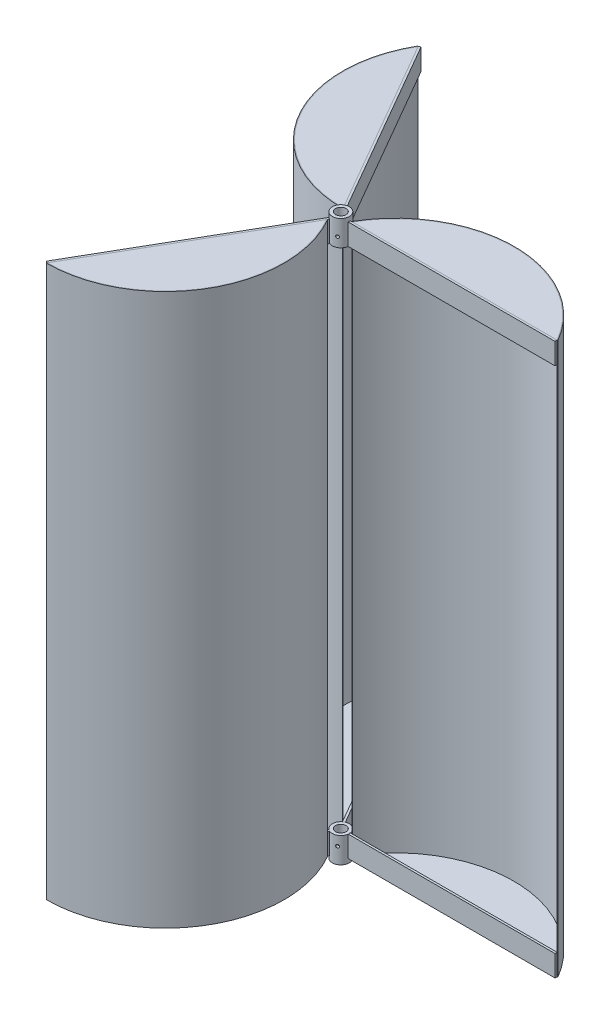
from build123d import *

# Parameters (mm, degrees)
SKETCH1_R           = 20
SKETCH1_R_2         = 12.5
BOSS_EXTRUDE1_DEPTH = 60
BOSS_EXTRUDE2_DEPTH = 50
CIRPATTERN1_COUNT   = 3
BOSS_EXTRUDE3_DEPTH = 5
BOSS_EXTRUDE5_DEPTH = 1300
CIRPATTERN2_COUNT   = 3
CIRPATTERN3_COUNT   = 2
CIRPATTERN3_ANGLE   = 120


with BuildPart() as part:
    # Sketch1 → Boss-Extrude1 (new body)
    with BuildSketch(Plane(origin=(0, 0, 0), x_dir=(1, 0, 0), z_dir=(0, 1, 0))):
        with Locations(Location((0, 0, 0), (0, 0, 270))):
            Circle(SKETCH1_R)
        with Locations(Location((0, 0, 0), (0, 0, 270))):
            Circle(SKETCH1_R_2, mode=Mode.SUBTRACT)
    extrude(amount=BOSS_EXTRUDE1_DEPTH)

    # Sketch6 → M8x1.0 Tapped Hole1 (revolve, cut)
    with BuildSketch(Plane(origin=(-19.99878655, 22.360679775, -0.220310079), x_dir=(-0.011015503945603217, 0, 0.9999393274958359), z_dir=(0, 1, 0))):
        Polygon((0, 0), (0, 19), (3.5, 16.896987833), (3.5, 0), align=None)
    m8x1_0_tapped_hole1 = revolve(axis=Axis((-26.34840128, 22.360679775, -0.290258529), (0.9999393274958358, 0, 0.011015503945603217)), mode=Mode.SUBTRACT)

    # CirPattern3: M8x1.0 Tapped Hole1 ×2 about axis
    cirpattern3_axis = Axis((0, 0, 0), (0, 1, 0))
    for i in range(1, CIRPATTERN3_COUNT):
        add(m8x1_0_tapped_hole1.rotate(cirpattern3_axis, i * CIRPATTERN3_ANGLE / (CIRPATTERN3_COUNT - 1)), mode=Mode.SUBTRACT)


with BuildPart() as body_2:
    # Sketch2 → Boss-Extrude2 (new body)
    with BuildSketch(Plane.XZ):
        with BuildLine():
            Line((19.843134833, -2.5), (507.5, -2.5))
            Line((507.5, -2.5), (507.5, 2.5))
            Line((507.5, 2.5), (19.843134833, 2.5))
            ThreePointArc((19.843134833, 2.5), (20, 0), (19.843134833, -2.5))
        make_face()
    extrude(amount=-BOSS_EXTRUDE2_DEPTH)


with BuildPart() as cirpattern1_1:
    # CirPattern1: pattern copy
    add(body_2.part.rotate(Axis((0, 0, 0), (0, 1, 0)), 1 * 360 / CIRPATTERN1_COUNT))


with BuildPart() as cirpattern1_2:
    # CirPattern1: pattern copy
    add(body_2.part.rotate(Axis((0, 0, 0), (0, 1, 0)), 2 * 360 / CIRPATTERN1_COUNT))


with BuildPart() as body_5:
    # Sketch3 → Boss-Extrude3 (new body)
    with BuildSketch(Plane(origin=(0, 50, 0), x_dir=(1, 0, 0), z_dir=(0, 1, 0))):
        with BuildLine():
            Line((24.950645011, 2.5), (507.5, 2.5))
            ThreePointArc((507.5, 2.5), (266.225322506, 141.8), (24.950645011, 2.5))
        make_face()
    extrude(amount=-BOSS_EXTRUDE3_DEPTH)


with BuildPart() as body_6:
    # Sketch5 → Boss-Extrude5 (new body)
    with BuildSketch(Plane(origin=(0, 50, 0), x_dir=(1, 0, 0), z_dir=(0, 1, 0))):
        with BuildLine():
            Line((23.651606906, 3.25), (24.950645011, 2.5))
            ThreePointArc((24.950645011, 2.5), (266.225322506, 141.8), (507.5, 2.5))
            Line((507.5, 2.5), (508.799038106, 3.25))
            ThreePointArc((508.799038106, 3.25), (266.225322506, 143.3), (23.651606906, 3.25))
        make_face()
    extrude(amount=-BOSS_EXTRUDE5_DEPTH)


with BuildPart() as cirpattern2_1:
    # CirPattern2: pattern copy
    add(body_6.part.rotate(Axis((0, 0, 0), (0, 1, 0)), 1 * 360 / CIRPATTERN2_COUNT))


with BuildPart() as cirpattern2_2:
    # CirPattern2: pattern copy
    add(body_6.part.rotate(Axis((0, 0, 0), (0, 1, 0)), 2 * 360 / CIRPATTERN2_COUNT))


with BuildPart() as cirpattern2_3:
    # CirPattern2: pattern copy
    add(body_5.part.rotate(Axis((0, 0, 0), (0, 1, 0)), 1 * 360 / CIRPATTERN2_COUNT))


with BuildPart() as cirpattern2_4:
    # CirPattern2: pattern copy
    add(body_5.part.rotate(Axis((0, 0, 0), (0, 1, 0)), 2 * 360 / CIRPATTERN2_COUNT))


with BuildPart() as body_11:
    # Mirror1: mirrored copy
    add(part.part.mirror(Plane.ZX.offset(-600)))


with BuildPart() as body_12:
    # Mirror1 2: mirrored copy
    add(body_2.part.mirror(Plane.ZX.offset(-600)))


with BuildPart() as body_13:
    # Mirror1 3: mirrored copy
    add(cirpattern1_1.part.mirror(Plane.ZX.offset(-600)))


with BuildPart() as body_14:
    # Mirror1 4: mirrored copy
    add(cirpattern1_2.part.mirror(Plane.ZX.offset(-600)))


with BuildPart() as body_15:
    # Mirror1 5: mirrored copy
    add(body_5.part.mirror(Plane.ZX.offset(-600)))


with BuildPart() as body_16:
    # Mirror1 6: mirrored copy
    add(cirpattern2_3.part.mirror(Plane.ZX.offset(-600)))


with BuildPart() as body_17:
    # Mirror1 7: mirrored copy
    add(cirpattern2_4.part.mirror(Plane.ZX.offset(-600)))


solid = Compound([part.part, body_2.part, cirpattern1_1.part, cirpattern1_2.part, body_5.part, body_6.part, cirpattern2_1.part, cirpattern2_2.part, cirpattern2_3.part, cirpattern2_4.part, body_11.part, body_12.part, body_13.part, body_14.part, body_15.part, body_16.part, body_17.part])
